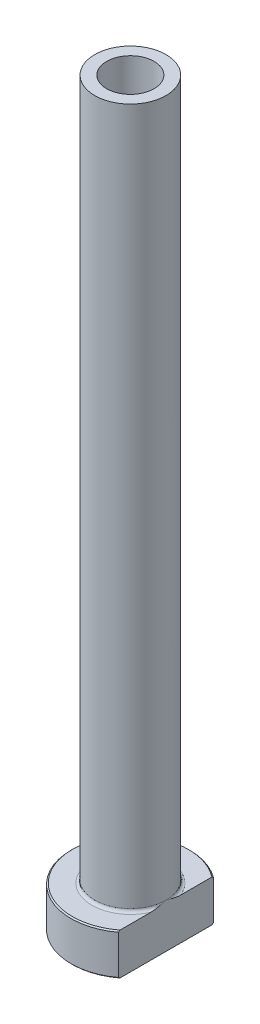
ISO-10303-21;
HEADER;
FILE_DESCRIPTION(('STEP AP214'),'2;1');
FILE_NAME('part.step','',(''),(''),'','','');
FILE_SCHEMA(('AUTOMOTIVE_DESIGN { 1 0 10303 214 1 1 1 1 }'));
ENDSEC;
DATA;
#1=APPLICATION_CONTEXT('core data for automotive mechanical design processes');
#2=APPLICATION_PROTOCOL_DEFINITION('international standard','automotive_design',2000,#1);
#3=PRODUCT_CONTEXT('',#1,'mechanical');
#4=PRODUCT('Part','Part','',(#3));
#5=PRODUCT_RELATED_PRODUCT_CATEGORY('part','',(#4));
#6=PRODUCT_DEFINITION_FORMATION('','',#4);
#7=PRODUCT_DEFINITION_CONTEXT('part definition',#1,'design');
#8=PRODUCT_DEFINITION('design','',#6,#7);
#9=PRODUCT_DEFINITION_SHAPE('','',#8);
#10=(LENGTH_UNIT() NAMED_UNIT(*) SI_UNIT(.MILLI.,.METRE.));
#11=(NAMED_UNIT(*) PLANE_ANGLE_UNIT() SI_UNIT($,.RADIAN.));
#12=(NAMED_UNIT(*) SI_UNIT($,.STERADIAN.) SOLID_ANGLE_UNIT());
#13=UNCERTAINTY_MEASURE_WITH_UNIT(LENGTH_MEASURE(1.E-05),#10,'distance_accuracy_value','');
#14=(GEOMETRIC_REPRESENTATION_CONTEXT(3) GLOBAL_UNCERTAINTY_ASSIGNED_CONTEXT((#13)) GLOBAL_UNIT_ASSIGNED_CONTEXT((#10,
#11,#12)) REPRESENTATION_CONTEXT('',''));
#15=CARTESIAN_POINT('',(0.,0.,0.));
#16=DIRECTION('',(0.,0.,1.));
#17=DIRECTION('',(1.,0.,0.));
#18=AXIS2_PLACEMENT_3D('',#15,#16,#17);
#19=CARTESIAN_POINT('',(0.,92.1876809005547,0.));
#20=DIRECTION('',(0.,1.,0.));
#21=DIRECTION('',(0.,0.,1.));
#22=AXIS2_PLACEMENT_3D('',#19,#20,#21);
#23=CYLINDRICAL_SURFACE('',#22,4.);
#24=CARTESIAN_POINT('',(0.,125.,0.));
#25=DIRECTION('',(0.,1.,0.));
#26=DIRECTION('',(0.,0.,1.));
#27=AXIS2_PLACEMENT_3D('',#24,#25,#26);
#28=CIRCLE('',#27,4.);
#29=CARTESIAN_POINT('',(0.,125.,4.));
#30=VERTEX_POINT('',#29);
#31=EDGE_CURVE('E167',#30,#30,#28,.T.);
#32=ORIENTED_EDGE('',*,*,#31,.T.);
#33=EDGE_LOOP('',(#32));
#34=FACE_BOUND('',#33,.T.);
#35=CARTESIAN_POINT('',(0.,80.,0.));
#36=DIRECTION('',(0.,1.,0.));
#37=DIRECTION('',(0.,0.,1.));
#38=AXIS2_PLACEMENT_3D('',#35,#36,#37);
#39=CIRCLE('',#38,4.);
#40=CARTESIAN_POINT('',(0.,80.,4.));
#41=VERTEX_POINT('',#40);
#42=EDGE_CURVE('E170',#41,#41,#39,.T.);
#43=ORIENTED_EDGE('',*,*,#42,.F.);
#44=EDGE_LOOP('',(#43));
#45=FACE_BOUND('',#44,.T.);
#46=ADVANCED_FACE('F32',(#34,#45),#23,.F.);
#47=CARTESIAN_POINT('',(-4.,125.,0.));
#48=DIRECTION('',(0.,1.,0.));
#49=DIRECTION('',(0.,0.,1.));
#50=AXIS2_PLACEMENT_3D('',#47,#48,#49);
#51=PLANE('',#50);
#52=CARTESIAN_POINT('',(0.,125.,0.));
#53=DIRECTION('',(0.,1.,0.));
#54=DIRECTION('',(0.,0.,1.));
#55=AXIS2_PLACEMENT_3D('',#52,#53,#54);
#56=CIRCLE('',#55,6.);
#57=CARTESIAN_POINT('',(0.,125.,6.));
#58=VERTEX_POINT('',#57);
#59=EDGE_CURVE('E174',#58,#58,#56,.T.);
#60=ORIENTED_EDGE('',*,*,#59,.T.);
#61=EDGE_LOOP('',(#60));
#62=FACE_BOUND('',#61,.T.);
#63=ORIENTED_EDGE('',*,*,#31,.F.);
#64=EDGE_LOOP('',(#63));
#65=FACE_BOUND('',#64,.T.);
#66=ADVANCED_FACE('F157',(#62,#65),#51,.T.);
#67=CARTESIAN_POINT('',(0.,92.1876809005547,0.));
#68=DIRECTION('',(0.,1.,0.));
#69=DIRECTION('',(0.,0.,1.));
#70=AXIS2_PLACEMENT_3D('',#67,#68,#69);
#71=CYLINDRICAL_SURFACE('',#70,6.);
#72=CARTESIAN_POINT('',(0.,7.50000000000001,0.));
#73=DIRECTION('',(0.,1.,0.));
#74=DIRECTION('',(0.,0.,1.));
#75=AXIS2_PLACEMENT_3D('',#72,#73,#74);
#76=CIRCLE('',#75,6.);
#77=CARTESIAN_POINT('',(6.,7.50000000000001,0.));
#78=VERTEX_POINT('',#77);
#79=EDGE_CURVE('E180',#78,#78,#76,.T.);
#80=ORIENTED_EDGE('',*,*,#79,.T.);
#81=EDGE_LOOP('',(#80));
#82=FACE_BOUND('',#81,.T.);
#83=ORIENTED_EDGE('',*,*,#59,.F.);
#84=EDGE_LOOP('',(#83));
#85=FACE_BOUND('',#84,.T.);
#86=ADVANCED_FACE('F162',(#82,#85),#71,.T.);
#87=CARTESIAN_POINT('',(-5.99999999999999,7.,0.));
#88=DIRECTION('',(0.,1.,0.));
#89=DIRECTION('',(0.,0.,1.));
#90=AXIS2_PLACEMENT_3D('',#87,#88,#89);
#91=PLANE('',#90);
#92=DIRECTION('',(0.,0.,1.));
#93=VECTOR('',#92,1.);
#94=CARTESIAN_POINT('',(6.,7.,0.));
#95=LINE('',#94,#93);
#96=CARTESIAN_POINT('',(6.,7.,-7.7485482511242));
#97=VERTEX_POINT('',#96);
#98=CARTESIAN_POINT('',(6.,7.,-2.5));
#99=VERTEX_POINT('',#98);
#100=EDGE_CURVE('E54',#97,#99,#95,.T.);
#101=ORIENTED_EDGE('',*,*,#100,.F.);
#102=CARTESIAN_POINT('',(0.,7.,0.));
#103=DIRECTION('',(0.,1.,0.));
#104=DIRECTION('',(0.,0.,1.));
#105=AXIS2_PLACEMENT_3D('',#102,#103,#104);
#106=CIRCLE('',#105,9.79999999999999);
#107=CARTESIAN_POINT('',(5.99999999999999,7.,7.7485482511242));
#108=VERTEX_POINT('',#107);
#109=EDGE_CURVE('E186',#97,#108,#106,.T.);
#110=ORIENTED_EDGE('',*,*,#109,.T.);
#111=CARTESIAN_POINT('',(6.,7.,2.5));
#112=VERTEX_POINT('',#111);
#113=EDGE_CURVE('E134',#112,#108,#95,.T.);
#114=ORIENTED_EDGE('',*,*,#113,.F.);
#115=CARTESIAN_POINT('',(0.,7.,0.));
#116=DIRECTION('',(0.,1.,0.));
#117=DIRECTION('',(0.,0.,1.));
#118=AXIS2_PLACEMENT_3D('',#115,#116,#117);
#119=CIRCLE('',#118,6.5);
#120=EDGE_CURVE('E183',#112,#99,#119,.F.);
#121=ORIENTED_EDGE('',*,*,#120,.T.);
#122=EDGE_LOOP('',(#101,#110,#114,#121));
#123=FACE_BOUND('',#122,.T.);
#124=ADVANCED_FACE('F197',(#123),#91,.T.);
#125=CARTESIAN_POINT('',(0.,92.1876809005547,0.));
#126=DIRECTION('',(0.,1.,0.));
#127=DIRECTION('',(0.,0.,1.));
#128=AXIS2_PLACEMENT_3D('',#125,#126,#127);
#129=CYLINDRICAL_SURFACE('',#128,9.99999999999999);
#130=DIRECTION('',(0.,-1.,0.));
#131=VECTOR('',#130,1.);
#132=CARTESIAN_POINT('',(5.99999999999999,125.,7.99999999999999));
#133=LINE('',#132,#131);
#134=CARTESIAN_POINT('',(5.99999999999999,6.8,7.99999999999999));
#135=VERTEX_POINT('',#134);
#136=CARTESIAN_POINT('',(5.99999999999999,0.200000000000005,7.99999999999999));
#137=VERTEX_POINT('',#136);
#138=EDGE_CURVE('E82',#135,#137,#133,.T.);
#139=ORIENTED_EDGE('',*,*,#138,.F.);
#140=CARTESIAN_POINT('',(0.,6.8,0.));
#141=DIRECTION('',(0.,1.,0.));
#142=DIRECTION('',(0.,0.,1.));
#143=AXIS2_PLACEMENT_3D('',#140,#141,#142);
#144=CIRCLE('',#143,9.99999999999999);
#145=CARTESIAN_POINT('',(6.,6.8,-7.99999999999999));
#146=VERTEX_POINT('',#145);
#147=EDGE_CURVE('E95',#135,#146,#144,.F.);
#148=ORIENTED_EDGE('',*,*,#147,.T.);
#149=DIRECTION('',(0.,-1.,0.));
#150=VECTOR('',#149,1.);
#151=CARTESIAN_POINT('',(6.,125.,-7.99999999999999));
#152=LINE('',#151,#150);
#153=CARTESIAN_POINT('',(6.,0.200000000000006,-7.99999999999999));
#154=VERTEX_POINT('',#153);
#155=EDGE_CURVE('E192',#146,#154,#152,.T.);
#156=ORIENTED_EDGE('',*,*,#155,.T.);
#157=CARTESIAN_POINT('',(0.,0.200000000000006,0.));
#158=DIRECTION('',(0.,-1.,0.));
#159=DIRECTION('',(0.,0.,-1.));
#160=AXIS2_PLACEMENT_3D('',#157,#158,#159);
#161=CIRCLE('',#160,9.99999999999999);
#162=EDGE_CURVE('E98',#154,#137,#161,.F.);
#163=ORIENTED_EDGE('',*,*,#162,.T.);
#164=EDGE_LOOP('',(#139,#148,#156,#163));
#165=FACE_BOUND('',#164,.T.);
#166=ADVANCED_FACE('F190',(#165),#129,.T.);
#167=CARTESIAN_POINT('',(-9.99999999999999,0.,0.));
#168=DIRECTION('',(0.,-1.,0.));
#169=DIRECTION('',(0.,0.,-1.));
#170=AXIS2_PLACEMENT_3D('',#167,#168,#169);
#171=PLANE('',#170);
#172=CARTESIAN_POINT('',(0.,0.,0.));
#173=DIRECTION('',(0.,-1.,0.));
#174=DIRECTION('',(0.,0.,-1.));
#175=AXIS2_PLACEMENT_3D('',#172,#173,#174);
#176=CIRCLE('',#175,4.74999999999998);
#177=CARTESIAN_POINT('',(0.,0.,-4.74999999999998));
#178=VERTEX_POINT('',#177);
#179=EDGE_CURVE('E40',#178,#178,#176,.F.);
#180=ORIENTED_EDGE('',*,*,#179,.T.);
#181=EDGE_LOOP('',(#180));
#182=FACE_BOUND('',#181,.T.);
#183=DIRECTION('',(0.,0.,-1.));
#184=VECTOR('',#183,1.);
#185=CARTESIAN_POINT('',(5.99999999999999,0.,7.99999999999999));
#186=LINE('',#185,#184);
#187=CARTESIAN_POINT('',(5.99999999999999,0.,7.74854825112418));
#188=VERTEX_POINT('',#187);
#189=CARTESIAN_POINT('',(6.,0.,-7.74854825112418));
#190=VERTEX_POINT('',#189);
#191=EDGE_CURVE('E47',#188,#190,#186,.T.);
#192=ORIENTED_EDGE('',*,*,#191,.F.);
#193=CARTESIAN_POINT('',(0.,0.,0.));
#194=DIRECTION('',(0.,-1.,0.));
#195=DIRECTION('',(0.,0.,-1.));
#196=AXIS2_PLACEMENT_3D('',#193,#194,#195);
#197=CIRCLE('',#196,9.79999999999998);
#198=EDGE_CURVE('E92',#188,#190,#197,.T.);
#199=ORIENTED_EDGE('',*,*,#198,.T.);
#200=EDGE_LOOP('',(#192,#199));
#201=FACE_BOUND('',#200,.T.);
#202=ADVANCED_FACE('F91',(#182,#201),#171,.T.);
#203=CARTESIAN_POINT('',(0.,92.1876809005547,0.));
#204=DIRECTION('',(0.,1.,0.));
#205=DIRECTION('',(0.,0.,1.));
#206=AXIS2_PLACEMENT_3D('',#203,#204,#205);
#207=CYLINDRICAL_SURFACE('',#206,4.24999999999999);
#208=CARTESIAN_POINT('',(0.,0.5,0.));
#209=DIRECTION('',(0.,-1.,0.));
#210=DIRECTION('',(0.,0.,-1.));
#211=AXIS2_PLACEMENT_3D('',#208,#209,#210);
#212=CIRCLE('',#211,4.24999999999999);
#213=CARTESIAN_POINT('',(0.,0.5,-4.24999999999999));
#214=VERTEX_POINT('',#213);
#215=EDGE_CURVE('E11',#214,#214,#212,.T.);
#216=ORIENTED_EDGE('',*,*,#215,.T.);
#217=EDGE_LOOP('',(#216));
#218=FACE_BOUND('',#217,.T.);
#219=CARTESIAN_POINT('',(0.,68.,0.));
#220=DIRECTION('',(0.,1.,0.));
#221=DIRECTION('',(0.,0.,1.));
#222=AXIS2_PLACEMENT_3D('',#219,#220,#221);
#223=CIRCLE('',#222,4.25);
#224=CARTESIAN_POINT('',(0.,68.,4.25));
#225=VERTEX_POINT('',#224);
#226=EDGE_CURVE('E172',#225,#225,#223,.T.);
#227=ORIENTED_EDGE('',*,*,#226,.T.);
#228=EDGE_LOOP('',(#227));
#229=FACE_BOUND('',#228,.T.);
#230=ADVANCED_FACE('F215',(#218,#229),#207,.F.);
#231=CARTESIAN_POINT('',(0.,68.,0.));
#232=DIRECTION('',(0.,-1.,0.));
#233=DIRECTION('',(0.,0.,-1.));
#234=AXIS2_PLACEMENT_3D('',#231,#232,#233);
#235=CONICAL_SURFACE('',#234,4.25,0.0208303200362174);
#236=ORIENTED_EDGE('',*,*,#42,.T.);
#237=EDGE_LOOP('',(#236));
#238=FACE_BOUND('',#237,.T.);
#239=ORIENTED_EDGE('',*,*,#226,.F.);
#240=EDGE_LOOP('',(#239));
#241=FACE_BOUND('',#240,.T.);
#242=ADVANCED_FACE('F111',(#238,#241),#235,.F.);
#243=CARTESIAN_POINT('',(0.,7.50000000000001,0.));
#244=DIRECTION('',(0.,1.,0.));
#245=DIRECTION('',(0.,0.,1.));
#246=AXIS2_PLACEMENT_3D('',#243,#244,#245);
#247=TOROIDAL_SURFACE('',#246,6.5,0.5);
#248=ORIENTED_EDGE('',*,*,#120,.F.);
#249=CARTESIAN_POINT('',(6.,7.50000000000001,0.));
#250=CARTESIAN_POINT('',(6.,7.50000080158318,6.70437634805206E-11));
#251=CARTESIAN_POINT('',(6.,7.50000160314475,2.62462613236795E-07));
#252=CARTESIAN_POINT('',(6.,7.50000311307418,1.01907176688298E-06));
#253=CARTESIAN_POINT('',(6.,7.50000381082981,1.52837915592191E-06));
#254=CARTESIAN_POINT('',(6.,7.5000052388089,2.74467594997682E-06));
#255=CARTESIAN_POINT('',(6.,7.5000059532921,3.47066702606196E-06));
#256=CARTESIAN_POINT('',(6.,7.50000725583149,4.99336157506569E-06));
#257=CARTESIAN_POINT('',(6.,7.50000784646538,5.78800097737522E-06));
#258=CARTESIAN_POINT('',(6.,7.50000997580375,8.79661545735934E-06));
#259=CARTESIAN_POINT('',(6.,7.50001139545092,1.10980668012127E-05));
#260=CARTESIAN_POINT('',(6.,7.50001378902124,1.57116088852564E-05));
#261=CARTESIAN_POINT('',(6.,7.50001478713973,1.80117437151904E-05));
#262=CARTESIAN_POINT('',(6.,7.50001885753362,2.75423829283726E-05));
#263=CARTESIAN_POINT('',(6.,7.500021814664,3.48285069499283E-05));
#264=CARTESIAN_POINT('',(6.,7.50002628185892,4.8740838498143E-05));
#265=CARTESIAN_POINT('',(6.,7.50002793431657,5.53214370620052E-05));
#266=CARTESIAN_POINT('',(6.,7.50003978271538,0.000103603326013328));
#267=CARTESIAN_POINT('',(6.,7.50004857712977,0.000145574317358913));
#268=CARTESIAN_POINT('',(5.99999999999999,7.50008704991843,0.000310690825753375));
#269=CARTESIAN_POINT('',(6.,7.50012394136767,0.0004321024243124));
#270=CARTESIAN_POINT('',(6.,7.50026686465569,0.000911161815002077));
#271=CARTESIAN_POINT('',(6.,7.50036807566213,0.00126981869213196));
#272=CARTESIAN_POINT('',(5.99999999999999,7.50077195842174,0.00268961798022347));
#273=CARTESIAN_POINT('',(5.99999999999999,7.50108058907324,0.00374948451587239));
#274=CARTESIAN_POINT('',(6.,7.50236320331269,0.00816658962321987));
#275=CARTESIAN_POINT('',(6.,7.50332976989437,0.0115254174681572));
#276=CARTESIAN_POINT('',(5.99999999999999,7.51709821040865,0.059354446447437));
#277=CARTESIAN_POINT('',(5.99999999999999,7.52995465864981,0.103813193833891));
#278=CARTESIAN_POINT('',(6.,7.55506029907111,0.190977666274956));
#279=CARTESIAN_POINT('',(6.,7.56731321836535,0.233682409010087));
#280=CARTESIAN_POINT('',(5.99999999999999,7.59325665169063,0.324512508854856));
#281=CARTESIAN_POINT('',(6.,7.60693346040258,0.372641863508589));
#282=CARTESIAN_POINT('',(6.,7.63422038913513,0.469489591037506));
#283=CARTESIAN_POINT('',(6.,7.64782813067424,0.518208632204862));
#284=CARTESIAN_POINT('',(6.,7.68043734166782,0.636338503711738));
#285=CARTESIAN_POINT('',(6.,7.69928754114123,0.705791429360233));
#286=CARTESIAN_POINT('',(6.,7.73566887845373,0.84310273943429));
#287=CARTESIAN_POINT('',(6.,7.75322160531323,0.910955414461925));
#288=CARTESIAN_POINT('',(6.,7.80024878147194,1.09857433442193));
#289=CARTESIAN_POINT('',(6.,7.82864900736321,1.21861610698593));
#290=CARTESIAN_POINT('',(6.,7.88105633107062,1.46081534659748));
#291=CARTESIAN_POINT('',(6.,7.9050208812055,1.58298212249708));
#292=CARTESIAN_POINT('',(6.,7.94810499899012,1.83866408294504));
#293=CARTESIAN_POINT('',(6.,7.96665856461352,1.97228081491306));
#294=CARTESIAN_POINT('',(6.,7.98621697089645,2.17329578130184));
#295=CARTESIAN_POINT('',(6.,7.99135613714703,2.24029152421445));
#296=CARTESIAN_POINT('',(6.,7.99832928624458,2.37444824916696));
#297=CARTESIAN_POINT('',(6.,8.00016429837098,2.44160917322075));
#298=CARTESIAN_POINT('',(6.,7.99984674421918,2.56298631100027));
#299=CARTESIAN_POINT('',(6.,7.99839439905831,2.61720324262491));
#300=CARTESIAN_POINT('',(6.,7.99236557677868,2.72552036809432));
#301=CARTESIAN_POINT('',(6.,7.98778645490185,2.77962042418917));
#302=CARTESIAN_POINT('',(6.,7.97492915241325,2.88664710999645));
#303=CARTESIAN_POINT('',(6.,7.96670262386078,2.93957965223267));
#304=CARTESIAN_POINT('',(6.,7.94570253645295,3.04448333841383));
#305=CARTESIAN_POINT('',(6.,7.93293488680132,3.09645563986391));
#306=CARTESIAN_POINT('',(6.,7.90135968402,3.19943606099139));
#307=CARTESIAN_POINT('',(6.,7.88247175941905,3.25042120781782));
#308=CARTESIAN_POINT('',(6.,7.84818685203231,3.32403783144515));
#309=CARTESIAN_POINT('',(6.,7.83579052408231,3.34806431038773));
#310=CARTESIAN_POINT('',(6.,7.80866016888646,3.39474488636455));
#311=CARTESIAN_POINT('',(6.,7.79392968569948,3.41740099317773));
#312=CARTESIAN_POINT('',(6.,7.76577135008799,3.45524173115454));
#313=CARTESIAN_POINT('',(6.,7.75294719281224,3.47087266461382));
#314=CARTESIAN_POINT('',(6.,7.72556313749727,3.50058040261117));
#315=CARTESIAN_POINT('',(6.,7.71100204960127,3.51465612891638));
#316=CARTESIAN_POINT('',(6.,7.67984897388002,3.54077006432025));
#317=CARTESIAN_POINT('',(6.,7.66323651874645,3.55278430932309));
#318=CARTESIAN_POINT('',(6.,7.62815222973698,3.5737025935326));
#319=CARTESIAN_POINT('',(6.,7.60968501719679,3.58261412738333));
#320=CARTESIAN_POINT('',(6.,7.57639898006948,3.59454653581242));
#321=CARTESIAN_POINT('',(6.,7.56191673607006,3.59850385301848));
#322=CARTESIAN_POINT('',(6.,7.53249228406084,3.60392336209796));
#323=CARTESIAN_POINT('',(6.,7.51755044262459,3.6053874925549));
#324=CARTESIAN_POINT('',(6.,7.48761833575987,3.60568912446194));
#325=CARTESIAN_POINT('',(6.,7.47262803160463,3.6045228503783));
#326=CARTESIAN_POINT('',(6.,7.44306278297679,3.59966500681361));
#327=CARTESIAN_POINT('',(6.,7.42848812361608,3.59597174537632));
#328=CARTESIAN_POINT('',(6.,7.39702156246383,3.58531109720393));
#329=CARTESIAN_POINT('',(6.,7.38031267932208,3.5778073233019));
#330=CARTESIAN_POINT('',(6.,7.34834450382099,3.56018434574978));
#331=CARTESIAN_POINT('',(6.,7.33308764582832,3.55006085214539));
#332=CARTESIAN_POINT('',(6.,7.29715308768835,3.52252389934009));
#333=CARTESIAN_POINT('',(6.,7.27737832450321,3.50394102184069));
#334=CARTESIAN_POINT('',(6.,7.2408841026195,3.4639950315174));
#335=CARTESIAN_POINT('',(6.,7.2241730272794,3.44262455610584));
#336=CARTESIAN_POINT('',(6.,7.18148338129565,3.38088102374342));
#337=CARTESIAN_POINT('',(6.,7.15831783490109,3.33858120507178));
#338=CARTESIAN_POINT('',(6.,7.11822747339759,3.25128083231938));
#339=CARTESIAN_POINT('',(6.,7.10130560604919,3.20627901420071));
#340=CARTESIAN_POINT('',(6.,7.07193388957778,3.11375892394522));
#341=CARTESIAN_POINT('',(6.,7.05959256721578,3.06620687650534));
#342=CARTESIAN_POINT('',(6.,7.03888782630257,2.97022063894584));
#343=CARTESIAN_POINT('',(6.,7.03052890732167,2.92178551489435));
#344=CARTESIAN_POINT('',(6.,7.01697563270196,2.82374574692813));
#345=CARTESIAN_POINT('',(6.,7.01183067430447,2.77413446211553));
#346=CARTESIAN_POINT('',(6.,7.00435015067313,2.67475263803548));
#347=CARTESIAN_POINT('',(6.,7.00201229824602,2.62498226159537));
#348=CARTESIAN_POINT('',(6.,6.99897190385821,2.4937701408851));
#349=CARTESIAN_POINT('',(6.,7.0002500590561,2.4122829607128));
#350=CARTESIAN_POINT('',(6.,7.00775652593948,2.24952135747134));
#351=CARTESIAN_POINT('',(6.,7.013987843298,2.16824709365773));
#352=CARTESIAN_POINT('',(6.,7.03045087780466,2.00575531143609));
#353=CARTESIAN_POINT('',(6.,7.04070001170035,1.92453960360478));
#354=CARTESIAN_POINT('',(6.,7.06442774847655,1.76257601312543));
#355=CARTESIAN_POINT('',(6.,7.07790697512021,1.68182822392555));
#356=CARTESIAN_POINT('',(6.,7.11973611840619,1.45394312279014));
#357=CARTESIAN_POINT('',(6.,7.15113840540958,1.30736987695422));
#358=CARTESIAN_POINT('',(6.,7.21927147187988,1.01717316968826));
#359=CARTESIAN_POINT('',(6.,7.25594155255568,0.873534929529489));
#360=CARTESIAN_POINT('',(6.,7.30765759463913,0.680321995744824));
#361=CARTESIAN_POINT('',(6.,7.32124979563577,0.630351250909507));
#362=CARTESIAN_POINT('',(6.,7.34913735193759,0.529103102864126));
#363=CARTESIAN_POINT('',(6.,7.3634417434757,0.477828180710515));
#364=CARTESIAN_POINT('',(6.,7.38809313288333,0.390268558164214));
#365=CARTESIAN_POINT('',(6.,7.39837954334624,0.353966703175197));
#366=CARTESIAN_POINT('',(6.,7.41893445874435,0.281778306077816));
#367=CARTESIAN_POINT('',(5.99999999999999,7.42920197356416,0.245891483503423));
#368=CARTESIAN_POINT('',(6.,7.4486400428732,0.178137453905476));
#369=CARTESIAN_POINT('',(6.,7.45780513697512,0.146268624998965));
#370=CARTESIAN_POINT('',(5.99999999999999,7.47656016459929,0.0812304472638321));
#371=CARTESIAN_POINT('',(5.99999999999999,7.48615204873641,0.0480615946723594));
#372=CARTESIAN_POINT('',(6.,7.49666961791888,0.0115277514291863));
#373=CARTESIAN_POINT('',(6.,7.49763547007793,0.00817123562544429));
#374=CARTESIAN_POINT('',(5.99999999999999,7.49891791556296,0.00375466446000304));
#375=CARTESIAN_POINT('',(5.99999999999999,7.49922706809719,0.00269301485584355));
#376=CARTESIAN_POINT('',(6.,7.49963158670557,0.00127098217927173));
#377=CARTESIAN_POINT('',(6.,7.49973292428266,0.000911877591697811));
#378=CARTESIAN_POINT('',(6.,7.49987600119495,0.0004322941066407));
#379=CARTESIAN_POINT('',(5.99999999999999,7.49991291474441,0.000310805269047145));
#380=CARTESIAN_POINT('',(6.,7.49995140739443,0.000145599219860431));
#381=CARTESIAN_POINT('',(6.,7.49996020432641,0.000103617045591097));
#382=CARTESIAN_POINT('',(6.,7.49997205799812,5.53238199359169E-05));
#383=CARTESIAN_POINT('',(6.,7.49997371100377,4.87425673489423E-05));
#384=CARTESIAN_POINT('',(6.,7.49997817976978,3.48289237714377E-05));
#385=CARTESIAN_POINT('',(6.,7.4999811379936,2.75421760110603E-05));
#386=CARTESIAN_POINT('',(6.,7.49998520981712,1.80109000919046E-05));
#387=CARTESIAN_POINT('',(6.,7.49998620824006,1.571071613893E-05));
#388=CARTESIAN_POINT('',(6.,7.49998860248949,1.10971286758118E-05));
#389=CARTESIAN_POINT('',(6.,7.49999002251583,8.7956866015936E-06));
#390=CARTESIAN_POINT('',(6.,7.49999215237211,5.78714699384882E-06));
#391=CARTESIAN_POINT('',(6.,7.49999274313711,4.99254350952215E-06));
#392=CARTESIAN_POINT('',(6.,7.49999404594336,3.46994445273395E-06));
#393=CARTESIAN_POINT('',(6.,7.49999476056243,2.74401361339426E-06));
#394=CARTESIAN_POINT('',(6.,7.49999618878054,1.52785977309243E-06));
#395=CARTESIAN_POINT('',(6.,7.49999688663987,1.01863029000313E-06));
#396=CARTESIAN_POINT('',(6.,7.4999983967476,2.62215533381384E-07));
#397=CARTESIAN_POINT('',(6.,7.4999991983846,-6.70451583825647E-11));
#398=CARTESIAN_POINT('',(6.,7.50000000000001,0.));
#399=B_SPLINE_CURVE_WITH_KNOTS('',3,(#249,#250,#251,#252,#253,#254,#255,#256,#257,#258,#259,
#260,#261,#262,#263,#264,#265,#266,#267,#268,#269,#270,#271,#272,#273,#274,#275,#276,#277,#278,
#279,#280,#281,#282,#283,#284,#285,#286,#287,#288,#289,#290,#291,#292,#293,#294,#295,#296,#297,
#298,#299,#300,#301,#302,#303,#304,#305,#306,#307,#308,#309,#310,#311,#312,#313,#314,#315,#316,
#317,#318,#319,#320,#321,#322,#323,#324,#325,#326,#327,#328,#329,#330,#331,#332,#333,#334,#335,
#336,#337,#338,#339,#340,#341,#342,#343,#344,#345,#346,#347,#348,#349,#350,#351,#352,#353,#354,
#355,#356,#357,#358,#359,#360,#361,#362,#363,#364,#365,#366,#367,#368,#369,#370,#371,#372,#373,
#374,#375,#376,#377,#378,#379,#380,#381,#382,#383,#384,#385,#386,#387,#388,#389,#390,#391,#392,
#393,#394,#395,#396,#397,#398),.UNSPECIFIED.,.T.,.F.,(4,2,2,2,2,2,2,2,2,2,2,2,2,2,2,2,2,2,2,2,2,
2,2,2,2,2,2,2,2,2,2,2,2,2,2,2,2,2,2,2,2,2,2,2,2,2,2,2,2,2,2,2,2,2,2,2,2,2,2,2,2,2,2,2,2,2,2,2,2,
2,2,2,2,2,4),(0.,2.4153302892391E-06,5.00162109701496E-06,8.04116379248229E-06,
1.10092366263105E-05,1.90889802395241E-05,2.6604745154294E-05,5.01454154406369E-05,
7.04740122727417E-05,0.000199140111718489,0.000579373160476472,0.00169781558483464,
0.00500893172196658,0.0154949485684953,0.154330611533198,0.287615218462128,0.437719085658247,
0.589470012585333,0.805361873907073,1.01561737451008,1.38561400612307,1.75899405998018,
2.16331287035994,2.3648290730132,2.56628249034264,2.72891861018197,2.89169246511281,
3.05223140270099,3.21256219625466,3.37509011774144,3.45609970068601,3.53698744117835,
3.59753760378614,3.65812948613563,3.71938396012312,3.78048942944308,3.82533702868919,
3.87014974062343,3.91502681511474,3.9599339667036,4.01458097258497,4.06931803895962,
4.15026803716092,4.23143634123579,4.37530581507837,4.51924312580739,4.66640085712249,
4.81372446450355,4.96325999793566,5.11267360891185,5.35695170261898,5.60137814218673,
5.84687607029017,6.09242144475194,6.54191534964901,6.98659302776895,7.1419516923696,
7.30164895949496,7.41484221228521,7.52682205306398,7.62630458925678,7.72988447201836,
7.7403632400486,7.74367992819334,7.74479976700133,7.74518024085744,7.74530894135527,
7.74532927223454,7.74535281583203,7.74536033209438,7.74536841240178,7.74537138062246,
7.74537442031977,7.74537700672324,7.74537942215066),.UNSPECIFIED.);
#400=EDGE_CURVE('E126',#112,#78,#399,.T.);
#401=ORIENTED_EDGE('',*,*,#400,.T.);
#402=ORIENTED_EDGE('',*,*,#79,.F.);
#403=CARTESIAN_POINT('',(6.,7.50000000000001,0.));
#404=CARTESIAN_POINT('',(6.,7.49999919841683,-6.70423652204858E-11));
#405=CARTESIAN_POINT('',(6.,7.49999839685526,-2.62462611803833E-07));
#406=CARTESIAN_POINT('',(6.,7.49999688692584,-1.01907176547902E-06));
#407=CARTESIAN_POINT('',(6.,7.4999961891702,-1.52837915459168E-06));
#408=CARTESIAN_POINT('',(6.,7.49999476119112,-2.74467594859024E-06));
#409=CARTESIAN_POINT('',(6.,7.49999404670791,-3.47066702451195E-06));
#410=CARTESIAN_POINT('',(6.,7.49999274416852,-4.9933615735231E-06));
#411=CARTESIAN_POINT('',(6.,7.49999215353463,-5.78800097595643E-06));
#412=CARTESIAN_POINT('',(6.,7.49999002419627,-8.7966154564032E-06));
#413=CARTESIAN_POINT('',(6.,7.49998860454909,-1.10980667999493E-05));
#414=CARTESIAN_POINT('',(6.,7.49998621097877,-1.5711608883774E-05));
#415=CARTESIAN_POINT('',(6.,7.49998521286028,-1.80117437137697E-05));
#416=CARTESIAN_POINT('',(6.,7.49998114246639,-2.754238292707E-05));
#417=CARTESIAN_POINT('',(6.,7.49997818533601,-3.4828506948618E-05));
#418=CARTESIAN_POINT('',(6.,7.49997371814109,-4.87408384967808E-05));
#419=CARTESIAN_POINT('',(6.,7.49997206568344,-5.53214370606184E-05));
#420=CARTESIAN_POINT('',(6.,7.49996021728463,-0.000103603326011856));
#421=CARTESIAN_POINT('',(6.,7.49995142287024,-0.000145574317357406));
#422=CARTESIAN_POINT('',(5.99999999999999,7.49991295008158,-0.000310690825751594));
#423=CARTESIAN_POINT('',(6.,7.49987605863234,-0.000432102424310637));
#424=CARTESIAN_POINT('',(6.,7.49973313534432,-0.000911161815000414));
#425=CARTESIAN_POINT('',(6.,7.49963192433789,-0.00126981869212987));
#426=CARTESIAN_POINT('',(5.99999999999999,7.49922804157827,-0.002689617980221));
#427=CARTESIAN_POINT('',(5.99999999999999,7.49891941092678,-0.00374948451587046));
#428=CARTESIAN_POINT('',(6.,7.49763679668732,-0.00816658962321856));
#429=CARTESIAN_POINT('',(6.,7.49667023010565,-0.0115254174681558));
#430=CARTESIAN_POINT('',(5.99999999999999,7.48290178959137,-0.0593544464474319));
#431=CARTESIAN_POINT('',(5.99999999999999,7.47004534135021,-0.103813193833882));
#432=CARTESIAN_POINT('',(6.,7.44493970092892,-0.190977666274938));
#433=CARTESIAN_POINT('',(6.,7.43268678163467,-0.233682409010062));
#434=CARTESIAN_POINT('',(5.99999999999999,7.40674334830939,-0.324512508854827));
#435=CARTESIAN_POINT('',(6.,7.39306653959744,-0.372641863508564));
#436=CARTESIAN_POINT('',(6.,7.36577961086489,-0.469489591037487));
#437=CARTESIAN_POINT('',(6.,7.35217186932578,-0.518208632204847));
#438=CARTESIAN_POINT('',(6.,7.3195626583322,-0.63633850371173));
#439=CARTESIAN_POINT('',(6.,7.30071245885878,-0.705791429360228));
#440=CARTESIAN_POINT('',(6.,7.26433112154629,-0.843102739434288));
#441=CARTESIAN_POINT('',(6.,7.24677839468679,-0.910955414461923));
#442=CARTESIAN_POINT('',(6.,7.19975121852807,-1.09857433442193));
#443=CARTESIAN_POINT('',(6.,7.1713509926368,-1.21861610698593));
#444=CARTESIAN_POINT('',(6.,7.11894366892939,-1.46081534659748));
#445=CARTESIAN_POINT('',(6.,7.09497911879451,-1.58298212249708));
#446=CARTESIAN_POINT('',(6.,7.0518950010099,-1.83866408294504));
#447=CARTESIAN_POINT('',(6.,7.03334143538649,-1.97228081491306));
#448=CARTESIAN_POINT('',(6.,7.01378302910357,-2.17329578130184));
#449=CARTESIAN_POINT('',(6.,7.00864386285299,-2.24029152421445));
#450=CARTESIAN_POINT('',(6.,7.00167071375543,-2.37444824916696));
#451=CARTESIAN_POINT('',(6.,6.99983570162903,-2.44160917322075));
#452=CARTESIAN_POINT('',(6.,7.00015325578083,-2.56298631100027));
#453=CARTESIAN_POINT('',(6.,7.0016056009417,-2.61720324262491));
#454=CARTESIAN_POINT('',(6.,7.00763442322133,-2.72552036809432));
#455=CARTESIAN_POINT('',(6.,7.01221354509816,-2.77962042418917));
#456=CARTESIAN_POINT('',(6.,7.02507084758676,-2.88664710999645));
#457=CARTESIAN_POINT('',(6.,7.03329737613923,-2.93957965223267));
#458=CARTESIAN_POINT('',(6.,7.05429746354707,-3.04448333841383));
#459=CARTESIAN_POINT('',(6.,7.06706511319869,-3.09645563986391));
#460=CARTESIAN_POINT('',(6.,7.09864031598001,-3.19943606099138));
#461=CARTESIAN_POINT('',(6.,7.11752824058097,-3.25042120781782));
#462=CARTESIAN_POINT('',(6.,7.1518131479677,-3.32403783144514));
#463=CARTESIAN_POINT('',(6.,7.16420947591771,-3.34806431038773));
#464=CARTESIAN_POINT('',(6.,7.19133983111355,-3.39474488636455));
#465=CARTESIAN_POINT('',(6.,7.20607031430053,-3.41740099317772));
#466=CARTESIAN_POINT('',(6.,7.23422864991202,-3.45524173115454));
#467=CARTESIAN_POINT('',(6.,7.24705280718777,-3.47087266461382));
#468=CARTESIAN_POINT('',(6.,7.27443686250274,-3.50058040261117));
#469=CARTESIAN_POINT('',(6.,7.28899795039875,-3.51465612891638));
#470=CARTESIAN_POINT('',(6.,7.32015102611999,-3.54077006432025));
#471=CARTESIAN_POINT('',(6.,7.33676348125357,-3.55278430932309));
#472=CARTESIAN_POINT('',(6.,7.37184777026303,-3.5737025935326));
#473=CARTESIAN_POINT('',(6.,7.39031498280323,-3.58261412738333));
#474=CARTESIAN_POINT('',(6.,7.42360101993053,-3.59454653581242));
#475=CARTESIAN_POINT('',(6.,7.43808326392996,-3.59850385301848));
#476=CARTESIAN_POINT('',(6.,7.46750771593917,-3.60392336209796));
#477=CARTESIAN_POINT('',(6.,7.48244955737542,-3.6053874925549));
#478=CARTESIAN_POINT('',(6.,7.51238166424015,-3.60568912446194));
#479=CARTESIAN_POINT('',(6.,7.52737196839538,-3.6045228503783));
#480=CARTESIAN_POINT('',(6.,7.55693721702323,-3.59966500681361));
#481=CARTESIAN_POINT('',(6.,7.57151187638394,-3.59597174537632));
#482=CARTESIAN_POINT('',(6.,7.60297843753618,-3.58531109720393));
#483=CARTESIAN_POINT('',(6.,7.61968732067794,-3.5778073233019));
#484=CARTESIAN_POINT('',(6.,7.65165549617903,-3.56018434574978));
#485=CARTESIAN_POINT('',(6.,7.6669123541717,-3.55006085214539));
#486=CARTESIAN_POINT('',(6.,7.70284691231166,-3.52252389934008));
#487=CARTESIAN_POINT('',(6.,7.7226216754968,-3.50394102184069));
#488=CARTESIAN_POINT('',(6.,7.75911589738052,-3.4639950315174));
#489=CARTESIAN_POINT('',(6.,7.77582697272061,-3.44262455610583));
#490=CARTESIAN_POINT('',(6.,7.81851661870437,-3.38088102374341));
#491=CARTESIAN_POINT('',(6.,7.84168216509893,-3.33858120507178));
#492=CARTESIAN_POINT('',(6.,7.88177252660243,-3.25128083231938));
#493=CARTESIAN_POINT('',(6.,7.89869439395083,-3.2062790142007));
#494=CARTESIAN_POINT('',(6.,7.92806611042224,-3.11375892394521));
#495=CARTESIAN_POINT('',(6.,7.94040743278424,-3.06620687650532));
#496=CARTESIAN_POINT('',(6.,7.96111217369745,-2.97022063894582));
#497=CARTESIAN_POINT('',(6.,7.96947109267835,-2.92178551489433));
#498=CARTESIAN_POINT('',(6.,7.98302436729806,-2.8237457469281));
#499=CARTESIAN_POINT('',(6.,7.98816932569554,-2.7741344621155));
#500=CARTESIAN_POINT('',(6.,7.99564984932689,-2.67475263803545));
#501=CARTESIAN_POINT('',(6.,7.99798770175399,-2.62498226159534));
#502=CARTESIAN_POINT('',(6.,8.00102809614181,-2.49377014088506));
#503=CARTESIAN_POINT('',(6.,7.99974994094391,-2.41228296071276));
#504=CARTESIAN_POINT('',(6.,7.99224347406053,-2.2495213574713));
#505=CARTESIAN_POINT('',(6.,7.98601215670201,-2.16824709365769));
#506=CARTESIAN_POINT('',(6.,7.96954912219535,-2.00575531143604));
#507=CARTESIAN_POINT('',(6.,7.95929998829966,-1.92453960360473));
#508=CARTESIAN_POINT('',(6.,7.93557225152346,-1.76257601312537));
#509=CARTESIAN_POINT('',(6.,7.92209302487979,-1.68182822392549));
#510=CARTESIAN_POINT('',(6.,7.88026388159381,-1.45394312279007));
#511=CARTESIAN_POINT('',(6.,7.84886159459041,-1.30736987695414));
#512=CARTESIAN_POINT('',(6.,7.78072852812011,-1.01717316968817));
#513=CARTESIAN_POINT('',(6.,7.74405844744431,-0.873534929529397));
#514=CARTESIAN_POINT('',(6.,7.69234240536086,-0.680321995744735));
#515=CARTESIAN_POINT('',(6.,7.67875020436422,-0.630351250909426));
#516=CARTESIAN_POINT('',(6.,7.6508626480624,-0.529103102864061));
#517=CARTESIAN_POINT('',(6.,7.6365582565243,-0.477828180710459));
#518=CARTESIAN_POINT('',(6.,7.61190686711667,-0.390268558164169));
#519=CARTESIAN_POINT('',(6.,7.60162045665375,-0.353966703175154));
#520=CARTESIAN_POINT('',(6.,7.58106554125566,-0.281778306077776));
#521=CARTESIAN_POINT('',(5.99999999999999,7.57079802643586,-0.245891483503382));
#522=CARTESIAN_POINT('',(6.,7.5513599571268,-0.178137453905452));
#523=CARTESIAN_POINT('',(6.,7.54219486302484,-0.146268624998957));
#524=CARTESIAN_POINT('',(5.99999999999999,7.52343983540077,-0.0812304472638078));
#525=CARTESIAN_POINT('',(5.99999999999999,7.51384795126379,-0.048061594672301));
#526=CARTESIAN_POINT('',(6.,7.50333038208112,-0.0115277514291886));
#527=CARTESIAN_POINT('',(6.,7.50236452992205,-0.00817123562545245));
#528=CARTESIAN_POINT('',(5.99999999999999,7.50108208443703,-0.00375466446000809));
#529=CARTESIAN_POINT('',(5.99999999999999,7.5007729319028,-0.00269301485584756));
#530=CARTESIAN_POINT('',(6.,7.50036841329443,-0.00127098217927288));
#531=CARTESIAN_POINT('',(6.,7.50026707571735,-0.000911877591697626));
#532=CARTESIAN_POINT('',(6.,7.50012399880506,-0.000432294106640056));
#533=CARTESIAN_POINT('',(5.99999999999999,7.5000870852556,-0.000310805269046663));
#534=CARTESIAN_POINT('',(6.,7.50004859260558,-0.000145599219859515));
#535=CARTESIAN_POINT('',(6.,7.50003979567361,-0.000103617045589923));
#536=CARTESIAN_POINT('',(6.,7.50002794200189,-5.53238199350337E-05));
#537=CARTESIAN_POINT('',(6.,7.50002628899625,-4.87425673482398E-05));
#538=CARTESIAN_POINT('',(6.,7.50002182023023,-3.48289237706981E-05));
#539=CARTESIAN_POINT('',(6.,7.50001886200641,-2.75421760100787E-05));
#540=CARTESIAN_POINT('',(6.,7.50001479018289,-1.80109000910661E-05));
#541=CARTESIAN_POINT('',(6.,7.50001379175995,-1.5710716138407E-05));
#542=CARTESIAN_POINT('',(6.,7.50001139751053,-1.10971286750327E-05));
#543=CARTESIAN_POINT('',(6.,7.50000997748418,-8.79568660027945E-06));
#544=CARTESIAN_POINT('',(6.,7.5000078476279,-5.78714699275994E-06));
#545=CARTESIAN_POINT('',(6.,7.5000072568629,-4.99254350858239E-06));
#546=CARTESIAN_POINT('',(6.,7.50000595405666,-3.4699444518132E-06));
#547=CARTESIAN_POINT('',(6.,7.50000523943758,-2.74401361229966E-06));
#548=CARTESIAN_POINT('',(6.,7.50000381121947,-1.52785977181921E-06));
#549=CARTESIAN_POINT('',(6.,7.50000311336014,-1.01863028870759E-06));
#550=CARTESIAN_POINT('',(6.,7.50000160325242,-2.62215532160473E-07));
#551=CARTESIAN_POINT('',(6.,7.50000080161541,6.70463621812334E-11));
#552=CARTESIAN_POINT('',(6.,7.50000000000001,0.));
#553=B_SPLINE_CURVE_WITH_KNOTS('',3,(#403,#404,#405,#406,#407,#408,#409,#410,#411,#412,#413,
#414,#415,#416,#417,#418,#419,#420,#421,#422,#423,#424,#425,#426,#427,#428,#429,#430,#431,#432,
#433,#434,#435,#436,#437,#438,#439,#440,#441,#442,#443,#444,#445,#446,#447,#448,#449,#450,#451,
#452,#453,#454,#455,#456,#457,#458,#459,#460,#461,#462,#463,#464,#465,#466,#467,#468,#469,#470,
#471,#472,#473,#474,#475,#476,#477,#478,#479,#480,#481,#482,#483,#484,#485,#486,#487,#488,#489,
#490,#491,#492,#493,#494,#495,#496,#497,#498,#499,#500,#501,#502,#503,#504,#505,#506,#507,#508,
#509,#510,#511,#512,#513,#514,#515,#516,#517,#518,#519,#520,#521,#522,#523,#524,#525,#526,#527,
#528,#529,#530,#531,#532,#533,#534,#535,#536,#537,#538,#539,#540,#541,#542,#543,#544,#545,#546,
#547,#548,#549,#550,#551,#552),.UNSPECIFIED.,.T.,.F.,(4,2,2,2,2,2,2,2,2,2,2,2,2,2,2,2,2,2,2,2,2,
2,2,2,2,2,2,2,2,2,2,2,2,2,2,2,2,2,2,2,2,2,2,2,2,2,2,2,2,2,2,2,2,2,2,2,2,2,2,2,2,2,2,2,2,2,2,2,2,
2,2,2,2,2,4),(0.,2.41533028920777E-06,5.00162109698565E-06,8.04116379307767E-06,
1.10092366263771E-05,1.90889802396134E-05,2.66047451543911E-05,5.01454154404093E-05,
7.04740122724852E-05,0.000199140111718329,0.000579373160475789,0.00169781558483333,
0.00500893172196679,0.0154949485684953,0.154330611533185,0.287615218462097,0.437719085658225,
0.589470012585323,0.805361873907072,1.01561737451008,1.38561400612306,1.75899405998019,
2.16331287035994,2.3648290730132,2.56628249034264,2.72891861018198,2.89169246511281,
3.05223140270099,3.21256219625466,3.37509011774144,3.45609970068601,3.53698744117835,
3.59753760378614,3.65812948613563,3.71938396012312,3.78048942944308,3.8253370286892,
3.87014974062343,3.91502681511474,3.9599339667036,4.01458097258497,4.06931803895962,
4.15026803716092,4.2314363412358,4.37530581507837,4.5192431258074,4.66640085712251,
4.81372446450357,4.96325999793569,5.11267360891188,5.35695170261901,5.60137814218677,
5.84687607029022,6.092421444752,6.54191534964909,6.98659302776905,7.14195169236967,
7.30164895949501,7.41484221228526,7.52682205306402,7.6263045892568,7.72988447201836,
7.7403632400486,7.74367992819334,7.74479976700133,7.74518024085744,7.74530894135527,
7.74532927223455,7.74535281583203,7.74536033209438,7.74536841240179,7.74537138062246,
7.74537442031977,7.74537700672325,7.74537942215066),.UNSPECIFIED.);
#554=EDGE_CURVE('E135',#78,#99,#553,.T.);
#555=ORIENTED_EDGE('',*,*,#554,.T.);
#556=EDGE_LOOP('',(#248,#401,#402,#555));
#557=FACE_BOUND('',#556,.T.);
#558=ADVANCED_FACE('F141',(#557),#247,.F.);
#559=CARTESIAN_POINT('',(0.,7.00000000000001,0.));
#560=DIRECTION('',(0.,-1.,0.));
#561=DIRECTION('',(0.,0.,-1.));
#562=AXIS2_PLACEMENT_3D('',#559,#560,#561);
#563=CONICAL_SURFACE('',#562,9.79999999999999,0.785398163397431);
#564=CARTESIAN_POINT('',(6.,-1.795522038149,-17.6009499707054));
#565=CARTESIAN_POINT('',(6.,-1.52401937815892,-17.3141017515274));
#566=CARTESIAN_POINT('',(6.,-1.25287676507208,-17.0269132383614));
#567=CARTESIAN_POINT('',(6.,-0.711434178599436,-16.4517398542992));
#568=CARTESIAN_POINT('',(6.,-0.441134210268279,-16.1637549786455));
#569=CARTESIAN_POINT('',(6.,0.36894074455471,-15.2977662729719));
#570=CARTESIAN_POINT('',(6.,0.907258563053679,-14.718395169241));
#571=CARTESIAN_POINT('',(6.,1.72215780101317,-13.8331216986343));
#572=CARTESIAN_POINT('',(6.,2.0007113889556,-13.5290344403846));
#573=CARTESIAN_POINT('',(6.,2.55603074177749,-12.9192325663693));
#574=CARTESIAN_POINT('',(6.,2.83279651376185,-12.6135179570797));
#575=CARTESIAN_POINT('',(6.,3.38385174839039,-12.0004608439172));
#576=CARTESIAN_POINT('',(6.,3.65814356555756,-11.6931204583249));
#577=CARTESIAN_POINT('',(6.,4.20403297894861,-11.0760595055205));
#578=CARTESIAN_POINT('',(6.,4.47563060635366,-10.7663389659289));
#579=CARTESIAN_POINT('',(6.,5.01505245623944,-10.1444038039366));
#580=CARTESIAN_POINT('',(6.,5.28288153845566,-9.83219340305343));
#581=CARTESIAN_POINT('',(6.,5.81422935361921,-9.20408822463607));
#582=CARTESIAN_POINT('',(6.,6.07774785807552,-8.88819325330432));
#583=CARTESIAN_POINT('',(6.,6.60003626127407,-8.25062578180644));
#584=CARTESIAN_POINT('',(6.,6.85878611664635,-7.92893682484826));
#585=CARTESIAN_POINT('',(6.,7.36859509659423,-7.27955943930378));
#586=CARTESIAN_POINT('',(6.,7.61965542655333,-6.95187196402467));
#587=CARTESIAN_POINT('',(6.,7.98576066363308,-6.45775713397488));
#588=CARTESIAN_POINT('',(6.,8.10486172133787,-6.29433436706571));
#589=CARTESIAN_POINT('',(6.,8.34000134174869,-5.9653036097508));
#590=CARTESIAN_POINT('',(6.,8.45604001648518,-5.79969569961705));
#591=CARTESIAN_POINT('',(6.,8.68455547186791,-5.4658267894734));
#592=CARTESIAN_POINT('',(6.,8.79702913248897,-5.29756364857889));
#593=CARTESIAN_POINT('',(6.,9.01753757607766,-4.95816178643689));
#594=CARTESIAN_POINT('',(6.,9.12557269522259,-4.78702328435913));
#595=CARTESIAN_POINT('',(6.,9.3356082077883,-4.44248614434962));
#596=CARTESIAN_POINT('',(6.,9.43764111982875,-4.26910741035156));
#597=CARTESIAN_POINT('',(6.,9.63518094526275,-3.91862113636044));
#598=CARTESIAN_POINT('',(6.,9.73068703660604,-3.74151313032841));
#599=CARTESIAN_POINT('',(6.,9.91348788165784,-3.38344678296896));
#600=CARTESIAN_POINT('',(6.,10.0007956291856,-3.20249511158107));
#601=CARTESIAN_POINT('',(6.,10.1654678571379,-2.83615347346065));
#602=CARTESIAN_POINT('',(6.,10.242836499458,-2.65076540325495));
#603=CARTESIAN_POINT('',(6.,10.3476493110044,-2.37476230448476));
#604=CARTESIAN_POINT('',(6.,10.3798377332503,-2.28593872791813));
#605=CARTESIAN_POINT('',(6.,10.4412613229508,-2.10727300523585));
#606=CARTESIAN_POINT('',(6.,10.470496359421,-2.01743081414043));
#607=CARTESIAN_POINT('',(6.,10.5533861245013,-1.74635894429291));
#608=CARTESIAN_POINT('',(6.,10.6022144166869,-1.56361273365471));
#609=CARTESIAN_POINT('',(6.,10.6846214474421,-1.19573724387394));
#610=CARTESIAN_POINT('',(6.,10.718282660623,-1.01062662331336));
#611=CARTESIAN_POINT('',(6.,10.7689812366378,-0.638123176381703));
#612=CARTESIAN_POINT('',(6.,10.7860205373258,-0.450730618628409));
#613=CARTESIAN_POINT('',(6.,10.8025183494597,-0.0738640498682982));
#614=CARTESIAN_POINT('',(6.,10.8018548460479,0.115615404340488));
#615=CARTESIAN_POINT('',(6.,10.7826880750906,0.493653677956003));
#616=CARTESIAN_POINT('',(6.,10.7641846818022,0.682212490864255));
#617=CARTESIAN_POINT('',(6.,10.710325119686,1.05776266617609));
#618=CARTESIAN_POINT('',(6.,10.6748911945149,1.24474270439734));
#619=CARTESIAN_POINT('',(6.,10.5890121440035,1.61520150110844));
#620=CARTESIAN_POINT('',(6.,10.5385638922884,1.79867952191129));
#621=CARTESIAN_POINT('',(6.,10.3911282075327,2.26914112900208));
#622=CARTESIAN_POINT('',(6.,10.2842782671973,2.55302531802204));
#623=CARTESIAN_POINT('',(6.,10.0463958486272,3.11045503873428));
#624=CARTESIAN_POINT('',(6.,9.91534345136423,3.38399182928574));
#625=CARTESIAN_POINT('',(6.,9.70492342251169,3.78859721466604));
#626=CARTESIAN_POINT('',(5.99999999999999,9.63209854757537,3.92313856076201));
#627=CARTESIAN_POINT('',(5.99999999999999,9.48259417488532,4.19006838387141));
#628=CARTESIAN_POINT('',(5.99999999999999,9.40591462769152,4.32245683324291));
#629=CARTESIAN_POINT('',(5.99999999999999,9.24930540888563,4.58520549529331));
#630=CARTESIAN_POINT('',(5.99999999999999,9.169377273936,4.71556662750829));
#631=CARTESIAN_POINT('',(5.99999999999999,9.00669783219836,4.9745035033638));
#632=CARTESIAN_POINT('',(5.99999999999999,8.92394663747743,5.10307931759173));
#633=CARTESIAN_POINT('',(5.99999999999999,8.64351229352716,5.52985219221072));
#634=CARTESIAN_POINT('',(5.99999999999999,8.44039926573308,5.8244859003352));
#635=CARTESIAN_POINT('',(5.99999999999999,8.0246071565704,6.4069492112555));
#636=CARTESIAN_POINT('',(5.99999999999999,7.81192597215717,6.69477729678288));
#637=CARTESIAN_POINT('',(5.99999999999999,7.37931497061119,7.26525171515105));
#638=CARTESIAN_POINT('',(5.99999999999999,7.1593799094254,7.54789405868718));
#639=CARTESIAN_POINT('',(5.99999999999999,6.71413940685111,8.10886295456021));
#640=CARTESIAN_POINT('',(5.99999999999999,6.48883440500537,8.38718985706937));
#641=CARTESIAN_POINT('',(5.99999999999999,6.03331036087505,8.94128328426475));
#642=CARTESIAN_POINT('',(5.99999999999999,5.80307787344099,9.21703873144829));
#643=CARTESIAN_POINT('',(5.99999999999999,5.3392797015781,9.76573512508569));
#644=CARTESIAN_POINT('',(5.99999999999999,5.1057139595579,10.0386760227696));
#645=CARTESIAN_POINT('',(5.99999999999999,4.63600560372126,10.5821276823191));
#646=CARTESIAN_POINT('',(5.99999999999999,4.39986411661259,10.8526394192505));
#647=CARTESIAN_POINT('',(5.99999999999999,3.92539621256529,11.3917411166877));
#648=CARTESIAN_POINT('',(5.99999999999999,3.6870697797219,11.6603310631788));
#649=CARTESIAN_POINT('',(5.99999999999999,3.01761185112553,12.4097238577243));
#650=CARTESIAN_POINT('',(5.99999999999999,2.58447471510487,12.8887346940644));
#651=CARTESIAN_POINT('',(5.99999999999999,1.71393239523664,13.8429570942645));
#652=CARTESIAN_POINT('',(5.99999999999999,1.27652670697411,14.3181681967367));
#653=CARTESIAN_POINT('',(5.99999999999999,0.401335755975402,15.2626172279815));
#654=CARTESIAN_POINT('',(5.99999999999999,-0.0364292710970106,15.7318739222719));
#655=CARTESIAN_POINT('',(5.99999999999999,-0.694863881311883,16.4340144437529));
#656=CARTESIAN_POINT('',(5.99999999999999,-0.914623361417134,16.6677530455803));
#657=CARTESIAN_POINT('',(5.99999999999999,-1.35468319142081,17.1347195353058));
#658=CARTESIAN_POINT('',(5.99999999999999,-1.57498354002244,17.3679474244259));
#659=CARTESIAN_POINT('',(5.99999999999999,-1.79552203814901,17.6009499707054));
#660=B_SPLINE_CURVE_WITH_KNOTS('',3,(#564,#565,#566,#567,#568,#569,#570,#571,#572,#573,#574,
#575,#576,#577,#578,#579,#580,#581,#582,#583,#584,#585,#586,#587,#588,#589,#590,#591,#592,#593,
#594,#595,#596,#597,#598,#599,#600,#601,#602,#603,#604,#605,#606,#607,#608,#609,#610,#611,#612,
#613,#614,#615,#616,#617,#618,#619,#620,#621,#622,#623,#624,#625,#626,#627,#628,#629,#630,#631,
#632,#633,#634,#635,#636,#637,#638,#639,#640,#641,#642,#643,#644,#645,#646,#647,#648,#649,#650,
#651,#652,#653,#654,#655,#656,#657,#658,#659),.UNSPECIFIED.,.F.,.F.,(4,2,2,2,2,2,2,2,2,2,2,2,2,
2,2,2,2,2,2,2,2,2,2,2,2,2,2,2,2,2,2,2,2,2,2,2,2,2,2,2,2,2,2,2,2,2,2,4),(0.,1.18488703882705,
2.36978117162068,4.74232601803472,5.97947486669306,7.21661879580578,8.45242468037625,
9.68821624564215,10.9222327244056,12.1563144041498,13.3947518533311,14.6329941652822,
15.2396202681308,15.8462241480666,16.4533450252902,17.0604198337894,17.6638266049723,
18.2673092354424,18.8698186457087,19.4720749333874,19.7554574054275,20.0388524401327,
20.6057348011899,21.1694962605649,21.733191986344,22.3007739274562,22.8683598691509,
23.4385779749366,24.0089148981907,24.917253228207,25.8263424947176,26.2852509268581,
26.7441652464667,27.2028649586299,27.6615464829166,28.7348221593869,29.8083349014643,
30.8826415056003,31.9568604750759,33.0345254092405,34.1122089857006,35.1894386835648,
36.2666762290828,38.2040405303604,40.1416366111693,42.0668676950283,43.0293387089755,
43.9918074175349),.UNSPECIFIED.);
#661=EDGE_CURVE('E133',#146,#97,#660,.T.);
#662=ORIENTED_EDGE('',*,*,#661,.F.);
#663=ORIENTED_EDGE('',*,*,#147,.F.);
#664=EDGE_CURVE('E118',#108,#135,#660,.T.);
#665=ORIENTED_EDGE('',*,*,#664,.F.);
#666=ORIENTED_EDGE('',*,*,#109,.F.);
#667=EDGE_LOOP('',(#662,#663,#665,#666));
#668=FACE_BOUND('',#667,.T.);
#669=ADVANCED_FACE('F145',(#668),#563,.T.);
#670=CARTESIAN_POINT('',(0.,0.200000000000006,0.));
#671=DIRECTION('',(0.,1.,0.));
#672=DIRECTION('',(0.,0.,1.));
#673=AXIS2_PLACEMENT_3D('',#670,#671,#672);
#674=CONICAL_SURFACE('',#673,9.99999999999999,0.785398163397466);
#675=CARTESIAN_POINT('',(5.99999999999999,8.79552203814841,17.6009499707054));
#676=CARTESIAN_POINT('',(5.99999999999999,8.52401937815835,17.3141017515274));
#677=CARTESIAN_POINT('',(5.99999999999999,8.25287676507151,17.0269132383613));
#678=CARTESIAN_POINT('',(5.99999999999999,7.7114341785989,16.4517398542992));
#679=CARTESIAN_POINT('',(5.99999999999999,7.44113421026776,16.1637549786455));
#680=CARTESIAN_POINT('',(5.99999999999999,6.63105925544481,15.2977662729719));
#681=CARTESIAN_POINT('',(5.99999999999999,6.09274143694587,14.718395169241));
#682=CARTESIAN_POINT('',(5.99999999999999,5.27784219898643,13.8331216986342));
#683=CARTESIAN_POINT('',(5.99999999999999,4.99928861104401,13.5290344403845));
#684=CARTESIAN_POINT('',(5.99999999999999,4.44396925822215,12.9192325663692));
#685=CARTESIAN_POINT('',(5.99999999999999,4.1672034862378,12.6135179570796));
#686=CARTESIAN_POINT('',(5.99999999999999,3.61614825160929,12.0004608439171));
#687=CARTESIAN_POINT('',(5.99999999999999,3.34185643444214,11.6931204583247));
#688=CARTESIAN_POINT('',(5.99999999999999,2.79596702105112,11.0760595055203));
#689=CARTESIAN_POINT('',(5.99999999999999,2.52436939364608,10.7663389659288));
#690=CARTESIAN_POINT('',(5.99999999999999,1.98494754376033,10.1444038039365));
#691=CARTESIAN_POINT('',(5.99999999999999,1.71711846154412,9.83219340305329));
#692=CARTESIAN_POINT('',(5.99999999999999,1.18577064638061,9.20408822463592));
#693=CARTESIAN_POINT('',(5.99999999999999,0.922252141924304,8.88819325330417));
#694=CARTESIAN_POINT('',(5.99999999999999,0.399963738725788,8.25062578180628));
#695=CARTESIAN_POINT('',(5.99999999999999,0.141213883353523,7.92893682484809));
#696=CARTESIAN_POINT('',(5.99999999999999,-0.368595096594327,7.2795594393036));
#697=CARTESIAN_POINT('',(5.99999999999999,-0.619655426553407,6.95187196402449));
#698=CARTESIAN_POINT('',(5.99999999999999,-0.985760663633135,6.45775713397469));
#699=CARTESIAN_POINT('',(5.99999999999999,-1.10486172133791,6.29433436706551));
#700=CARTESIAN_POINT('',(5.99999999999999,-1.34000134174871,5.96530360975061));
#701=CARTESIAN_POINT('',(5.99999999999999,-1.4560400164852,5.79969569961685));
#702=CARTESIAN_POINT('',(5.99999999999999,-1.68455547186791,5.4658267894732));
#703=CARTESIAN_POINT('',(5.99999999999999,-1.79702913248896,5.29756364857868));
#704=CARTESIAN_POINT('',(5.99999999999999,-2.01753757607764,4.95816178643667));
#705=CARTESIAN_POINT('',(5.99999999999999,-2.12557269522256,4.78702328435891));
#706=CARTESIAN_POINT('',(5.99999999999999,-2.33560820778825,4.4424861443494));
#707=CARTESIAN_POINT('',(5.99999999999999,-2.43764111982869,4.26910741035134));
#708=CARTESIAN_POINT('',(5.99999999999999,-2.63518094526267,3.91862113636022));
#709=CARTESIAN_POINT('',(6.,-2.73068703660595,3.74151313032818));
#710=CARTESIAN_POINT('',(6.,-2.91348788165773,3.38344678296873));
#711=CARTESIAN_POINT('',(6.,-3.00079562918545,3.20249511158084));
#712=CARTESIAN_POINT('',(6.,-3.16546785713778,2.83615347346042));
#713=CARTESIAN_POINT('',(6.,-3.24283649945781,2.65076540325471));
#714=CARTESIAN_POINT('',(6.,-3.3476493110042,2.37476230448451));
#715=CARTESIAN_POINT('',(6.,-3.37983773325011,2.28593872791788));
#716=CARTESIAN_POINT('',(6.,-3.44126132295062,2.10727300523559));
#717=CARTESIAN_POINT('',(6.,-3.47049635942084,2.01743081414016));
#718=CARTESIAN_POINT('',(6.,-3.55338612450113,1.74635894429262));
#719=CARTESIAN_POINT('',(6.,-3.60221441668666,1.56361273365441));
#720=CARTESIAN_POINT('',(6.,-3.68462144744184,1.19573724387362));
#721=CARTESIAN_POINT('',(6.,-3.71828266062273,1.01062662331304));
#722=CARTESIAN_POINT('',(6.,-3.76898123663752,0.638123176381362));
#723=CARTESIAN_POINT('',(6.,-3.78602053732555,0.450730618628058));
#724=CARTESIAN_POINT('',(6.,-3.80251834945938,0.0738640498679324));
#725=CARTESIAN_POINT('',(6.,-3.80185484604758,-0.11561540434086));
#726=CARTESIAN_POINT('',(6.,-3.78268807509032,-0.493653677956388));
#727=CARTESIAN_POINT('',(6.,-3.76418468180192,-0.682212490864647));
#728=CARTESIAN_POINT('',(6.,-3.71032511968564,-1.05776266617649));
#729=CARTESIAN_POINT('',(6.,-3.67489119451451,-1.24474270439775));
#730=CARTESIAN_POINT('',(6.,-3.58901214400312,-1.61520150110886));
#731=CARTESIAN_POINT('',(6.,-3.53856389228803,-1.79867952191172));
#732=CARTESIAN_POINT('',(6.,-3.39112820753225,-2.26914112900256));
#733=CARTESIAN_POINT('',(6.,-3.28427826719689,-2.55302531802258));
#734=CARTESIAN_POINT('',(6.,-3.04639584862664,-3.11045503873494));
#735=CARTESIAN_POINT('',(5.99999999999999,-2.91534345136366,-3.38399182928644));
#736=CARTESIAN_POINT('',(6.,-2.70492342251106,-3.78859721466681));
#737=CARTESIAN_POINT('',(6.,-2.63209854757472,-3.92313856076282));
#738=CARTESIAN_POINT('',(6.,-2.48259417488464,-4.19006838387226));
#739=CARTESIAN_POINT('',(6.,-2.40591462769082,-4.32245683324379));
#740=CARTESIAN_POINT('',(6.,-2.24930540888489,-4.58520549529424));
#741=CARTESIAN_POINT('',(6.,-2.16937727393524,-4.71556662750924));
#742=CARTESIAN_POINT('',(6.,-2.00669783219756,-4.9745035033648));
#743=CARTESIAN_POINT('',(6.,-1.92394663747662,-5.10307931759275));
#744=CARTESIAN_POINT('',(6.,-1.64351229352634,-5.52985219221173));
#745=CARTESIAN_POINT('',(6.,-1.44039926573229,-5.82448590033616));
#746=CARTESIAN_POINT('',(6.,-1.02460715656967,-6.40694921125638));
#747=CARTESIAN_POINT('',(6.,-0.811925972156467,-6.69477729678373));
#748=CARTESIAN_POINT('',(6.,-0.379314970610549,-7.26525171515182));
#749=CARTESIAN_POINT('',(6.,-0.159379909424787,-7.54789405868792));
#750=CARTESIAN_POINT('',(6.,0.285860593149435,-8.10886295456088));
#751=CARTESIAN_POINT('',(6.,0.511165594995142,-8.38718985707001));
#752=CARTESIAN_POINT('',(6.,0.966689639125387,-8.94128328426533));
#753=CARTESIAN_POINT('',(6.,1.1969221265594,-9.21703873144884));
#754=CARTESIAN_POINT('',(6.,1.66072029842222,-9.76573512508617));
#755=CARTESIAN_POINT('',(6.,1.89428604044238,-10.03867602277));
#756=CARTESIAN_POINT('',(6.,2.36399439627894,-10.5821276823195));
#757=CARTESIAN_POINT('',(6.,2.60013588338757,-10.8526394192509));
#758=CARTESIAN_POINT('',(6.,3.0746037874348,-11.391741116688));
#759=CARTESIAN_POINT('',(6.,3.31293022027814,-11.6603310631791));
#760=CARTESIAN_POINT('',(6.,3.98238814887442,-12.4097238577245));
#761=CARTESIAN_POINT('',(6.,4.41552528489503,-12.8887346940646));
#762=CARTESIAN_POINT('',(6.,5.28606760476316,-13.8429570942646));
#763=CARTESIAN_POINT('',(6.,5.72347329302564,-14.3181681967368));
#764=CARTESIAN_POINT('',(6.,6.59866424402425,-15.2626172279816));
#765=CARTESIAN_POINT('',(6.,7.03642927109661,-15.731873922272));
#766=CARTESIAN_POINT('',(6.,7.69486388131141,-16.4340144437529));
#767=CARTESIAN_POINT('',(6.,7.91462336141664,-16.6677530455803));
#768=CARTESIAN_POINT('',(6.,8.35468319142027,-17.1347195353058));
#769=CARTESIAN_POINT('',(6.,8.57498354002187,-17.3679474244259));
#770=CARTESIAN_POINT('',(6.,8.79552203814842,-17.6009499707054));
#771=B_SPLINE_CURVE_WITH_KNOTS('',3,(#675,#676,#677,#678,#679,#680,#681,#682,#683,#684,#685,
#686,#687,#688,#689,#690,#691,#692,#693,#694,#695,#696,#697,#698,#699,#700,#701,#702,#703,#704,
#705,#706,#707,#708,#709,#710,#711,#712,#713,#714,#715,#716,#717,#718,#719,#720,#721,#722,#723,
#724,#725,#726,#727,#728,#729,#730,#731,#732,#733,#734,#735,#736,#737,#738,#739,#740,#741,#742,
#743,#744,#745,#746,#747,#748,#749,#750,#751,#752,#753,#754,#755,#756,#757,#758,#759,#760,#761,
#762,#763,#764,#765,#766,#767,#768,#769,#770),.UNSPECIFIED.,.F.,.F.,(4,2,2,2,2,2,2,2,2,2,2,2,2,
2,2,2,2,2,2,2,2,2,2,2,2,2,2,2,2,2,2,2,2,2,2,2,2,2,2,2,2,2,2,2,2,2,2,4),(0.,1.18488703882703,
2.36978117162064,4.74232601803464,5.97947486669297,7.21661879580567,8.45242468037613,
9.68821624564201,10.9222327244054,12.1563144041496,13.3947518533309,14.632994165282,
15.2396202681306,15.8462241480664,16.4533450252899,17.0604198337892,17.663826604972,
18.2673092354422,18.8698186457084,19.4720749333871,19.7554574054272,20.0388524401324,
20.6057348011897,21.1694962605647,21.7331919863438,22.3007739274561,22.8683598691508,
23.4385779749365,24.0089148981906,24.9172532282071,25.8263424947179,26.2852509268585,
26.7441652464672,27.2028649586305,27.6615464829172,28.7348221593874,29.8083349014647,
30.8826415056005,31.956860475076,33.0345254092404,34.1122089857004,35.1894386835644,
36.2666762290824,38.2040405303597,40.1416366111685,42.0668676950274,43.0293387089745,
43.9918074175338),.UNSPECIFIED.);
#772=EDGE_CURVE('E79',#137,#188,#771,.T.);
#773=ORIENTED_EDGE('',*,*,#772,.F.);
#774=ORIENTED_EDGE('',*,*,#162,.F.);
#775=EDGE_CURVE('E87',#190,#154,#771,.T.);
#776=ORIENTED_EDGE('',*,*,#775,.F.);
#777=ORIENTED_EDGE('',*,*,#198,.F.);
#778=EDGE_LOOP('',(#773,#774,#776,#777));
#779=FACE_BOUND('',#778,.T.);
#780=ADVANCED_FACE('F94',(#779),#674,.T.);
#781=CARTESIAN_POINT('',(5.99999999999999,125.,7.99999999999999));
#782=DIRECTION('',(-1.,0.,0.));
#783=DIRECTION('',(0.,0.,1.));
#784=AXIS2_PLACEMENT_3D('',#781,#782,#783);
#785=PLANE('',#784);
#786=ORIENTED_EDGE('',*,*,#400,.F.);
#787=ORIENTED_EDGE('',*,*,#113,.T.);
#788=ORIENTED_EDGE('',*,*,#664,.T.);
#789=ORIENTED_EDGE('',*,*,#138,.T.);
#790=ORIENTED_EDGE('',*,*,#772,.T.);
#791=ORIENTED_EDGE('',*,*,#191,.T.);
#792=ORIENTED_EDGE('',*,*,#775,.T.);
#793=ORIENTED_EDGE('',*,*,#155,.F.);
#794=ORIENTED_EDGE('',*,*,#661,.T.);
#795=ORIENTED_EDGE('',*,*,#100,.T.);
#796=ORIENTED_EDGE('',*,*,#554,.F.);
#797=EDGE_LOOP('',(#786,#787,#788,#789,#790,#791,#792,#793,#794,#795,#796));
#798=FACE_BOUND('',#797,.T.);
#799=ADVANCED_FACE('F80',(#798),#785,.F.);
#800=CARTESIAN_POINT('',(0.,0.,0.));
#801=DIRECTION('',(0.,-1.,0.));
#802=DIRECTION('',(0.,0.,-1.));
#803=AXIS2_PLACEMENT_3D('',#800,#801,#802);
#804=CONICAL_SURFACE('',#803,4.74999999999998,0.785398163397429);
#805=ORIENTED_EDGE('',*,*,#215,.F.);
#806=EDGE_LOOP('',(#805));
#807=FACE_BOUND('',#806,.T.);
#808=ORIENTED_EDGE('',*,*,#179,.F.);
#809=EDGE_LOOP('',(#808));
#810=FACE_BOUND('',#809,.T.);
#811=ADVANCED_FACE('F34',(#807,#810),#804,.F.);
#812=CLOSED_SHELL('',(#46,#66,#86,#124,#166,#202,#230,#242,#558,#669,#780,#799,#811));
#813=MANIFOLD_SOLID_BREP('B2',#812);
#814=ADVANCED_BREP_SHAPE_REPRESENTATION('',(#18,#813),#14);
#815=SHAPE_DEFINITION_REPRESENTATION(#9,#814);
ENDSEC;
END-ISO-10303-21;
